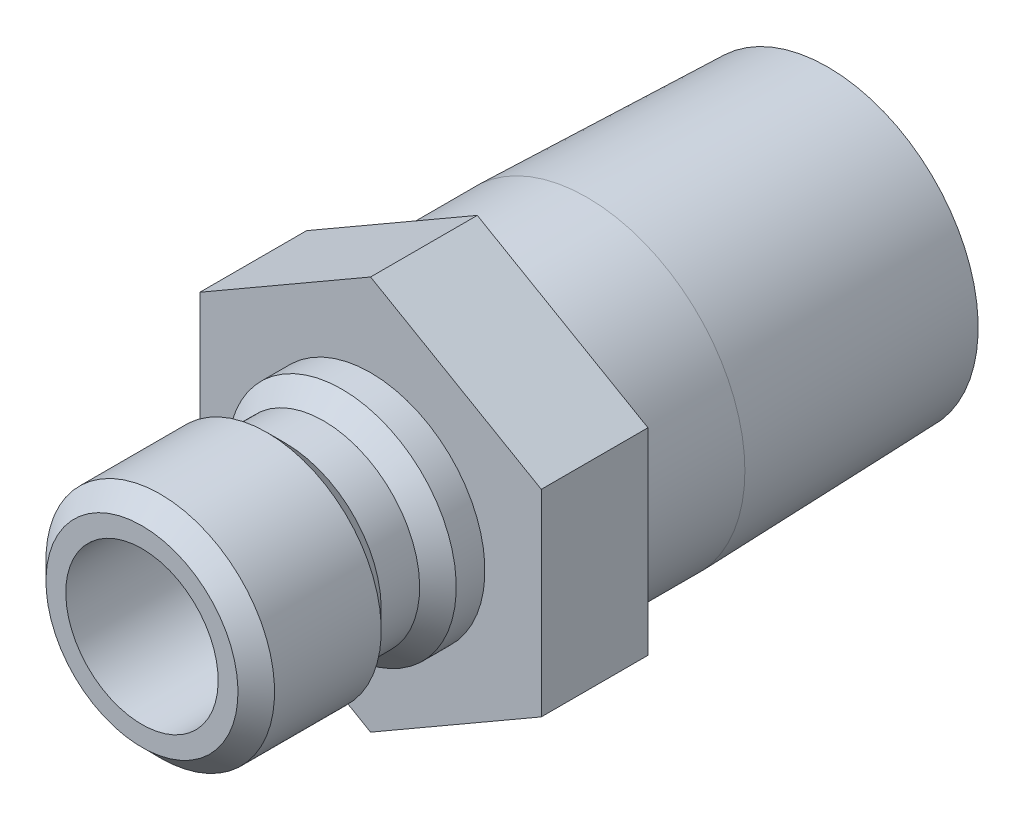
from build123d import *

# Parameters (mm, degrees)
SKETCH2_R           = 3.175
BOSS_EXTRUDE1_DEPTH = 4.445


with BuildPart() as part:
    # Sketch1 → Revolve1 (revolve)
    with BuildSketch(Plane(origin=(0, 0, 0), x_dir=(0, 0, -1), z_dir=(1, 0, 0))):
        Polygon((-9.525, 3.175), (-9.525, 4.0005), (-8.763, 4.7625), (-4.318, 4.7625), (-3.556, 4.0005), (-1.9558, 4.0005), (-1.1938, 4.7625), (0, 4.7625), (0, 6.5786), (9.017, 6.5786), (19.05, 6.265070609), (19.05, 4.6228), (0.127, 4.6228), (0.127, 3.175), align=None)
    revolve(axis=Axis((0, 0, 0), (0, 0, 1)))

    # Sketch2 → Boss-Extrude1 (add)
    with BuildSketch(Plane.XY):
        Polygon((-7.112, 4.106115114), (-7.112, -4.106115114), (0, -8.212230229), (7.112, -4.106115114), (7.112, 4.106115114), (0, 8.212230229), align=None)
        with Locations(Location((0, 0, 0), (0, 0, 90))):
            Circle(SKETCH2_R, mode=Mode.SUBTRACT)
    extrude(amount=-BOSS_EXTRUDE1_DEPTH)


solid = part.part
